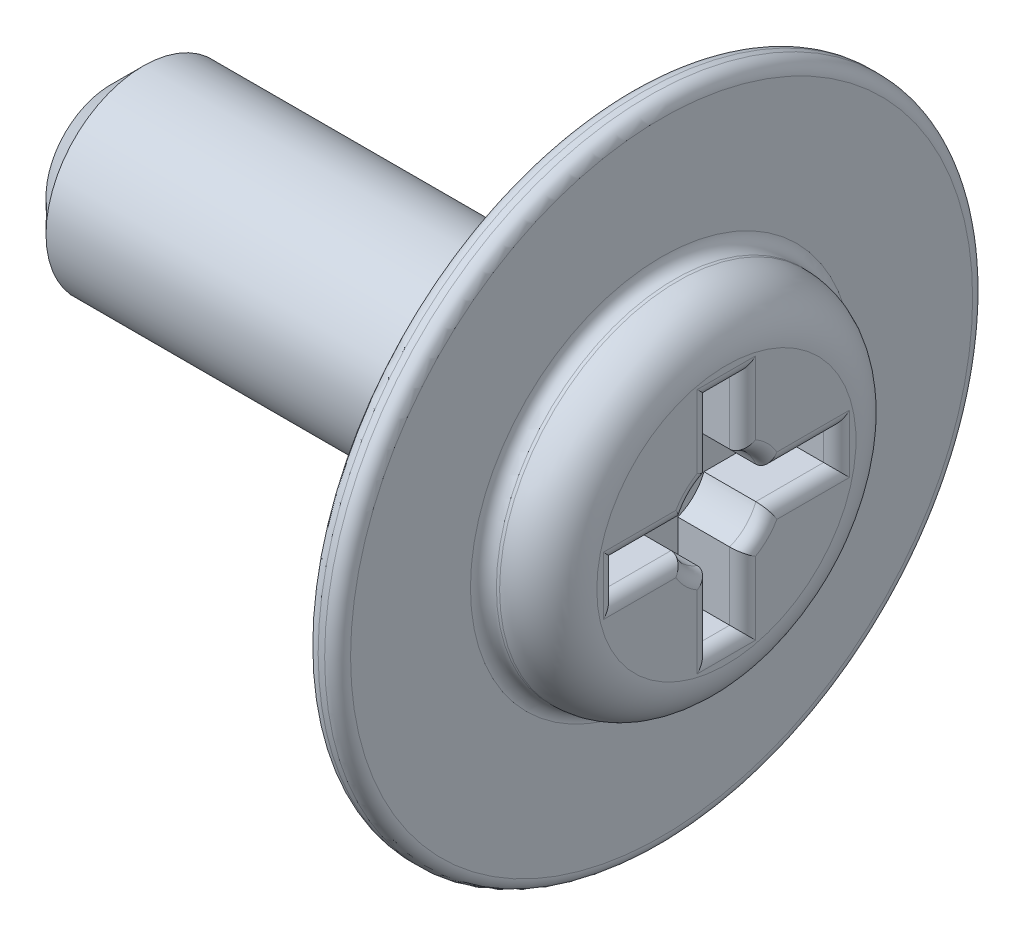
from build123d import *

# Parameters (mm, degrees)
ESQUISSE2_W                  = 0.5
ESQUISSE2_H                  = 1.7
ENL_V_MAT_EXTRU_1_DEPTH      = 1
R_P_TITION_CIRCULAIRE1_COUNT = 4
ESQUISSE3_R                  = 0.699771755
ENL_V_MAT_EXTRU_2_DEPTH      = 1
CHANFREIN1_SIZE              = 0.5
CONG_1_R                     = 0.2


with BuildPart() as part:
    # Esquisse1 → R_volution1 (revolve)
    with BuildSketch(Plane.XY, mode=Mode.PRIVATE) as r_volution1_sk:
        with BuildLine():
            Line((0, 0), (0, 1.5))
            Line((0, 1.5), (8, 1.5))
            Line((8, 1.5), (8, 5))
            Line((8, 5), (8.5, 5))
            Line((8.5, 5), (8.5, 2.75))
            Line((8.5, 2.75), (8.75, 2.75))
            ThreePointArc((8.75, 2.75), (9.280330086, 2.530330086), (9.5, 2))
            Line((9.5, 2), (9.5, 0))
            Line((9.5, 0), (0, 0))
        make_face()
    revolve(r_volution1_sk.sketch.rotate(Axis((0, 0, 0), (1, 0, 0)), 90), axis=Axis((0, 0, 0), (1, 0, 0)))

    # Esquisse2 → Enl_v. mat.-Extru.1 (cut)
    with BuildSketch(Plane(origin=(9.5, 0, 0), x_dir=(0, 0, -1), z_dir=(1, 0, 0))):
        with Locations((0, 0.85)):
            Rectangle(ESQUISSE2_W, ESQUISSE2_H)
    enl_v_mat_extru_1 = extrude(amount=-ENL_V_MAT_EXTRU_1_DEPTH, mode=Mode.SUBTRACT)

    # R_p_tition circulaire1: Enl_v. mat.-Extru.1 ×4 about axis
    r_p_tition_circulaire1_axis = Axis((0, 0, 0), (1, 0, 0))
    for i in range(1, R_P_TITION_CIRCULAIRE1_COUNT):
        add(enl_v_mat_extru_1.rotate(r_p_tition_circulaire1_axis, i * 360 / R_P_TITION_CIRCULAIRE1_COUNT), mode=Mode.SUBTRACT)

    # Esquisse3 → Enl_v. mat.-Extru.2 (cut)
    with BuildSketch(Plane(origin=(9.5, 0, 0), x_dir=(0, 0, -1), z_dir=(1, 0, 0))):
        Circle(ESQUISSE3_R)
    extrude(amount=-ENL_V_MAT_EXTRU_2_DEPTH, mode=Mode.SUBTRACT)

    # Chanfrein1
    chanfrein1_edges = [part.edges().sort_by_distance(p)[0] for p in [
        (0, 0, -1.5),
    ]]
    chamfer(chanfrein1_edges, length=CHANFREIN1_SIZE)

    # Cong_1
    cong_1_edges = [part.edges().sort_by_distance(p)[0] for p in [
        (8, 0, -5),
        (8.5, 0, -5),
        (8.5, 0, -2.75),
        (9.5, 0, 1.7),
        (9.5, -0.25, 1.176795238),
        (9.5, -0.494813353, 0.494813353),
        (9.5, -1.176795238, 0.25),
        (9.5, -1.7, 0),
        (9.5, -1.176795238, -0.25),
        (9.5, -0.494813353, -0.494813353),
        (9.5, -0.25, -1.176795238),
        (9.5, 0, -1.7),
        (9.5, 0.25, -1.176795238),
        (9.5, 0.494813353, -0.494813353),
        (9.5, 1.176795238, -0.25),
        (9.5, 1.7, 0),
        (9.5, 1.176795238, 0.25),
        (9.5, 0.494813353, 0.494813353),
        (9.5, 0.25, 1.176795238),
    ]]
    fillet(cong_1_edges, radius=CONG_1_R)


solid = part.part
